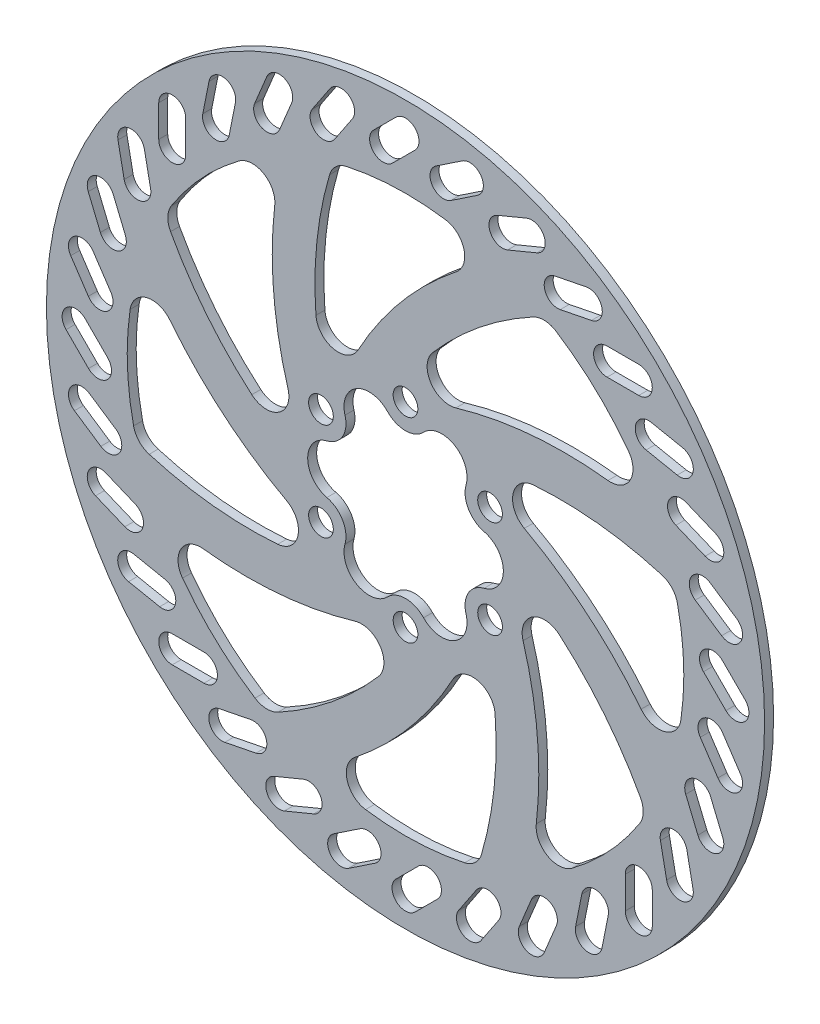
from build123d import *

# Parameters (mm, degrees)
ESQUISSE1_R                  = 80
BASE_EXTRUSION_DEPTH         = 2
ESQUISSE2_R                  = 15
ENL_V_MAT_EXTRU_1_DEPTH      = 114.154761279
ESQUISSE3_R                  = 2.75
ENL_V_MAT_EXTRU_2_DEPTH      = 114.154761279
R_P_TITION_CIRCULAIRE1_COUNT = 6
ENL_V_MAT_EXTRU_3_DEPTH      = 114.154761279
R_P_TITION_CIRCULAIRE2_COUNT = 6
ENL_V_MAT_EXTRU_4_DEPTH      = 114.154761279
R_P_TITION_CIRCULAIRE3_COUNT = 8
ENL_V_MAT_EXTRU_5_DEPTH      = 114.154761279
R_P_TITION_CIRCULAIRE4_COUNT = 32


with BuildPart() as part:
    # Esquisse1 → Base-Extrusion (new body)
    with BuildSketch(Plane.XY):
        Circle(ESQUISSE1_R)
    extrude(amount=BASE_EXTRUSION_DEPTH)

    # Esquisse2 → Enl_v. mat.-Extru.1 (cut, through all)
    with BuildSketch(Plane.XY.offset(2)):
        Circle(ESQUISSE2_R)
    extrude(amount=-ENL_V_MAT_EXTRU_1_DEPTH, mode=Mode.SUBTRACT)

    # Esquisse3 → Enl_v. mat.-Extru.2 (cut, through all)
    with BuildSketch(Plane.XY.offset(2)):
        with Locations((0, -21.75)):
            Circle(ESQUISSE3_R)
    enl_v_mat_extru_2 = extrude(amount=-ENL_V_MAT_EXTRU_2_DEPTH, mode=Mode.SUBTRACT)

    # R_p_tition circulaire1: Enl_v. mat.-Extru.2 ×6 about axis
    r_p_tition_circulaire1_axis = Axis((0, 0, 0), (0, 0, -1))
    for i in range(1, R_P_TITION_CIRCULAIRE1_COUNT):
        add(enl_v_mat_extru_2.rotate(r_p_tition_circulaire1_axis, i * 360 / R_P_TITION_CIRCULAIRE1_COUNT), mode=Mode.SUBTRACT)

    # Esquisse4 → Enl_v. mat.-Extru.3 (cut, through all)
    with BuildSketch(Plane.XY.offset(2)):
        with BuildLine():
            Line((0, 16.175), (0, 12.5))
            ThreePointArc((0, 12.5), (-6.25, 10.825317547), (-10.825317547, 6.25))
            Line((-10.825317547, 6.25), (-14.007960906, 8.0875))
            ThreePointArc((-14.007960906, 8.0875), (-13.301137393, 10.207662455), (-13.483780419, 12.435066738))
            ThreePointArc((-13.483780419, 12.435066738), (-10.897919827, 18.875750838), (-4.027193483, 17.894829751))
            ThreePointArc((-4.027193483, 17.894829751), (-2.189526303, 16.622954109), (0, 16.175))
        make_face()
    enl_v_mat_extru_3 = extrude(amount=-ENL_V_MAT_EXTRU_3_DEPTH, mode=Mode.SUBTRACT)

    # R_p_tition circulaire2: Enl_v. mat.-Extru.3 ×6 about axis
    r_p_tition_circulaire2_axis = Axis((0, 0, 0), (0, 0, -1))
    for i in range(1, R_P_TITION_CIRCULAIRE2_COUNT):
        add(enl_v_mat_extru_3.rotate(r_p_tition_circulaire2_axis, i * 360 / R_P_TITION_CIRCULAIRE2_COUNT), mode=Mode.SUBTRACT)

    # Esquisse5 → Enl_v. mat.-Extru.4 (cut, through all)
    with BuildSketch(Plane.XY.offset(2)):
        with BuildLine():
            ThreePointArc((49.681691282, 37.0908284), (42.276169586, 45.351135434), (33.517079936, 52.159422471))
            ThreePointArc((33.517079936, 52.159422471), (30.9954635, 52.949726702), (28.423184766, 52.344324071))
            ThreePointArc((28.423184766, 52.344324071), (16.400488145, 44.310467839), (6.020347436, 34.243653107))
            ThreePointArc((6.020347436, 34.243653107), (5.613553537, 28.267421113), (11.231690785, 26.189594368))
            ThreePointArc((11.231690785, 26.189594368), (28.01867378, 29.371822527), (45.102938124, 29.132477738))
            ThreePointArc((45.102938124, 29.132477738), (50.008998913, 31.606171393), (49.681691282, 37.0908284))
        make_face()
    enl_v_mat_extru_4 = extrude(amount=-ENL_V_MAT_EXTRU_4_DEPTH, mode=Mode.SUBTRACT)

    # R_p_tition circulaire3: Enl_v. mat.-Extru.4 ×8 about axis
    r_p_tition_circulaire3_axis = Axis((0, 0, 0), (0, 0, -1))
    for i in range(1, R_P_TITION_CIRCULAIRE3_COUNT):
        add(enl_v_mat_extru_4.rotate(r_p_tition_circulaire3_axis, i * 360 / R_P_TITION_CIRCULAIRE3_COUNT), mode=Mode.SUBTRACT)

    # Esquisse6 → Enl_v. mat.-Extru.5 (cut, through all)
    with BuildSketch(Plane.XY.offset(2)):
        with BuildLine():
            Line((-2.121320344, 75.621320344), (-7.121320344, 70.621320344))
            ThreePointArc((-7.121320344, 70.621320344), (-7.121320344, 66.378679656), (-2.878679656, 66.378679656))
            Line((-2.878679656, 66.378679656), (2.121320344, 71.378679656))
            ThreePointArc((2.121320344, 71.378679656), (2.121320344, 75.621320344), (-2.121320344, 75.621320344))
        make_face()
    enl_v_mat_extru_5 = extrude(amount=-ENL_V_MAT_EXTRU_5_DEPTH, mode=Mode.SUBTRACT)

    # R_p_tition circulaire4: Enl_v. mat.-Extru.5 ×32 about axis
    r_p_tition_circulaire4_axis = Axis((0, 0, 0), (0, 0, -1))
    for i in range(1, R_P_TITION_CIRCULAIRE4_COUNT):
        add(enl_v_mat_extru_5.rotate(r_p_tition_circulaire4_axis, i * 360 / R_P_TITION_CIRCULAIRE4_COUNT), mode=Mode.SUBTRACT)


solid = part.part
